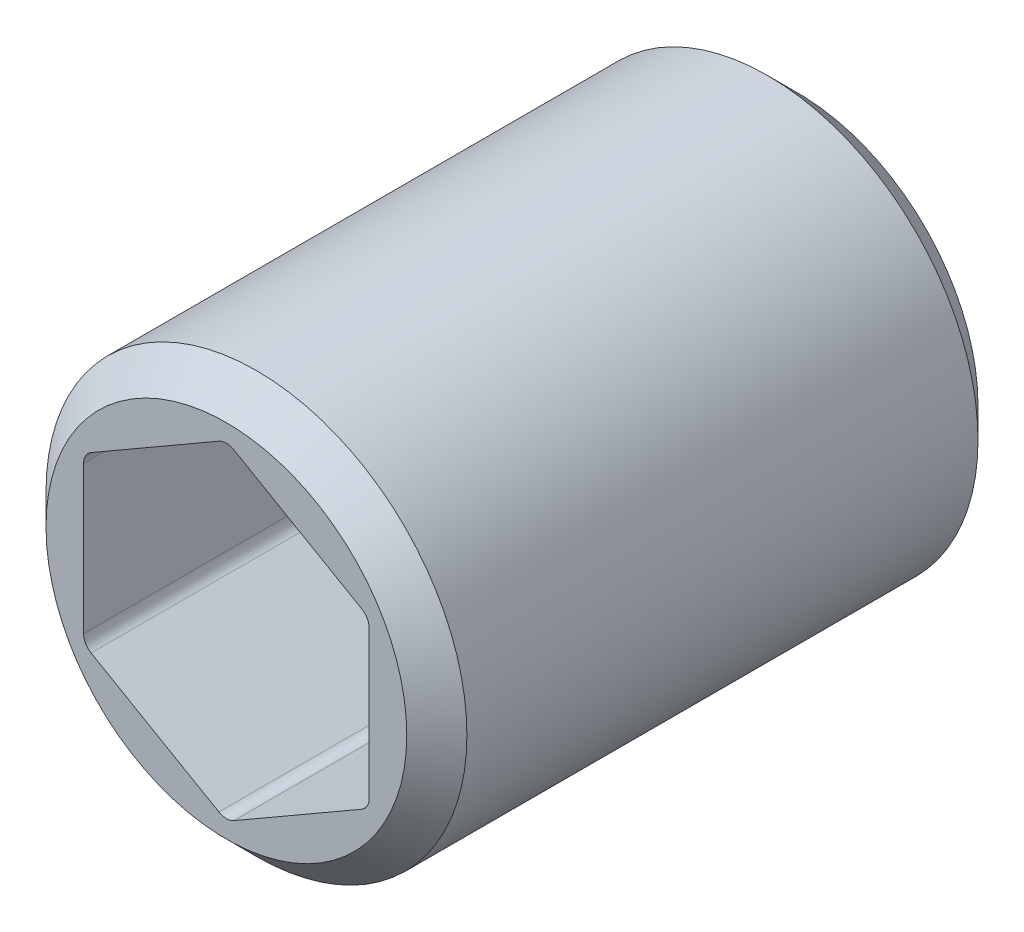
from build123d import *

# Parameters (mm, degrees)
ESQUISSE1_R             = 14
BASE_EXTRUSION_DEPTH    = 38
ENL_V_MAT_EXTRU_1_DEPTH = 14
ESQUISSE4_W             = 13
ESQUISSE4_H             = 13
ENL_V_MAT_EXTRU_2_DEPTH = 19
ESQUISSE5_R             = 6
ENL_V_MAT_EXTRU_3_DEPTH = 28.440845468
CONG_1_R                = 1
CHANFREIN1_SIZE         = 2
ENL_V_MAT_EXTRU_4_REACH = 44.849
ESQUISSE6_R             = 2.6


with BuildPart() as part:
    # Esquisse1 → Base-Extrusion (new body)
    with BuildSketch(Plane.XY):
        Circle(ESQUISSE1_R)
    extrude(amount=BASE_EXTRUSION_DEPTH)

    # Esquisse2 → Enl_v. mat.-Extru.1 (cut)
    with BuildSketch(Plane.XY.offset(38)):
        Polygon((0, -10.969655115), (9.5, -5.484827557), (9.5, 5.484827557), (0, 10.969655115), (-9.5, 5.484827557), (-9.5, -5.484827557), align=None)
    extrude(amount=-ENL_V_MAT_EXTRU_1_DEPTH, mode=Mode.SUBTRACT)

    # Esquisse4 → Enl_v. mat.-Extru.2 (cut)
    with BuildSketch(Plane(origin=(0, 0, 0), x_dir=(-1, 0, 0), z_dir=(0, 0, -1))):
        Rectangle(ESQUISSE4_W, ESQUISSE4_H)
    extrude(amount=-ENL_V_MAT_EXTRU_2_DEPTH, mode=Mode.SUBTRACT)

    # Esquisse5 → Enl_v. mat.-Extru.3 (cut, through all)
    with BuildSketch(Plane(origin=(0, 0, 19), x_dir=(-1, 0, 0), z_dir=(0, 0, -1))):
        Circle(ESQUISSE5_R)
    extrude(amount=-ENL_V_MAT_EXTRU_3_DEPTH, mode=Mode.SUBTRACT)

    # Cong_1
    cong_1_edges = [part.edges().sort_by_distance(p)[0] for p in [
        (6.5, 6.5, 9.5),
        (-6.5, 6.5, 9.5),
        (-6.5, -6.5, 9.5),
        (6.5, -6.5, 9.5),
        (0, -10.969655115, 31),
        (9.5, -5.484827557, 31),
        (9.5, 5.484827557, 31),
        (0, 10.969655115, 31),
        (-9.5, 5.484827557, 31),
        (-9.5, -5.484827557, 31),
    ]]
    fillet(cong_1_edges, radius=CONG_1_R)

    # Chanfrein1
    chanfrein1_edges = [part.edges().sort_by_distance(p)[0] for p in [
        (-14, 0, 0),
        (-14, 0, 38),
    ]]
    chamfer(chanfrein1_edges, length=CHANFREIN1_SIZE)

    # Esquisse6 → Enl_v. mat.-Extru.4 (cut, up to next)
    with BuildSketch(Plane(origin=(0, 0, 0), x_dir=(0, 0, -1), z_dir=(1, 0, 0)), mode=Mode.PRIVATE) as enl_v_mat_extru_4_sk1:
        with Locations((-9.982879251, -0.074830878)):
            Circle(ESQUISSE6_R)
    enl_v_mat_extru_4_tool1 = extrude(enl_v_mat_extru_4_sk1.sketch, amount=-ENL_V_MAT_EXTRU_4_REACH, mode=Mode.PRIVATE) & part.part
    add(enl_v_mat_extru_4_tool1.solids().sort_by_distance((0, -0.074831, 9.982879))[0], mode=Mode.SUBTRACT)


solid = part.part
